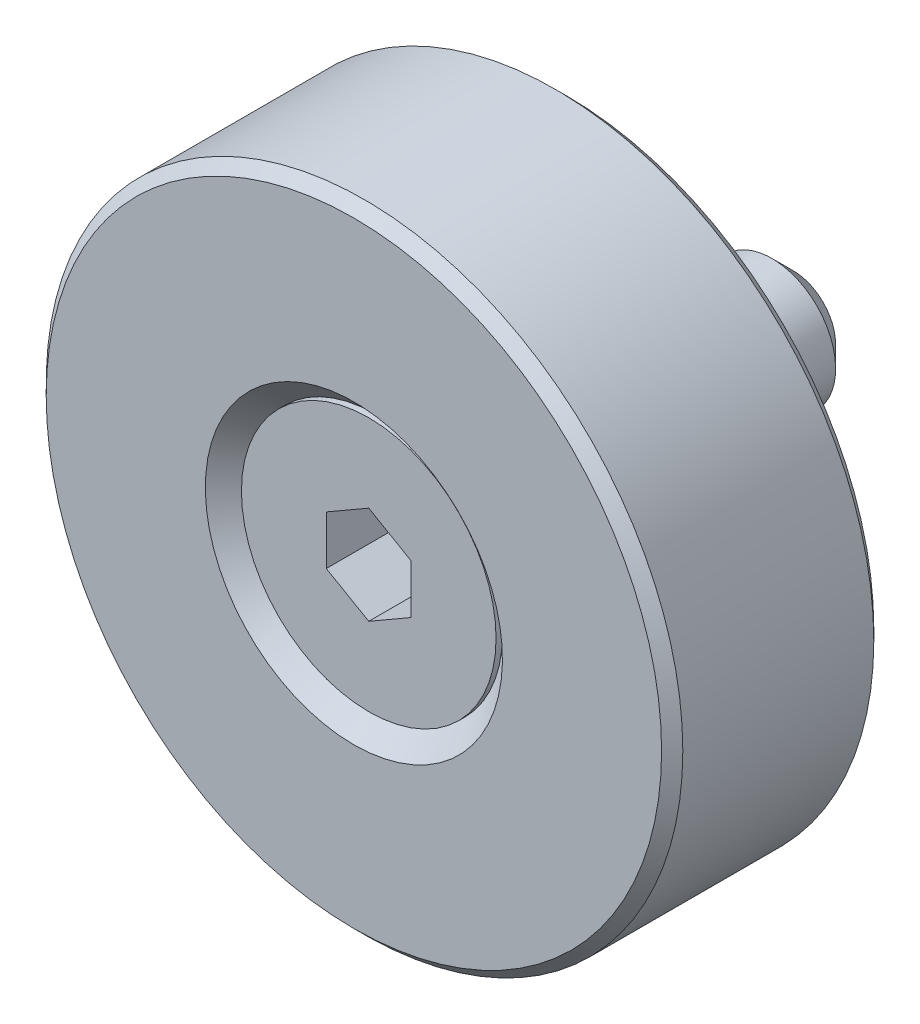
ISO-10303-21;
HEADER;
FILE_DESCRIPTION(('STEP AP214'),'2;1');
FILE_NAME('part.step','',(''),(''),'','','');
FILE_SCHEMA(('AUTOMOTIVE_DESIGN { 1 0 10303 214 1 1 1 1 }'));
ENDSEC;
DATA;
#1=APPLICATION_CONTEXT('core data for automotive mechanical design processes');
#2=APPLICATION_PROTOCOL_DEFINITION('international standard','automotive_design',2000,#1);
#3=PRODUCT_CONTEXT('',#1,'mechanical');
#4=PRODUCT('Part','Part','',(#3));
#5=PRODUCT_RELATED_PRODUCT_CATEGORY('part','',(#4));
#6=PRODUCT_DEFINITION_FORMATION('','',#4);
#7=PRODUCT_DEFINITION_CONTEXT('part definition',#1,'design');
#8=PRODUCT_DEFINITION('design','',#6,#7);
#9=PRODUCT_DEFINITION_SHAPE('','',#8);
#10=(LENGTH_UNIT() NAMED_UNIT(*) SI_UNIT(.MILLI.,.METRE.));
#11=(NAMED_UNIT(*) PLANE_ANGLE_UNIT() SI_UNIT($,.RADIAN.));
#12=(NAMED_UNIT(*) SI_UNIT($,.STERADIAN.) SOLID_ANGLE_UNIT());
#13=UNCERTAINTY_MEASURE_WITH_UNIT(LENGTH_MEASURE(1.E-05),#10,'distance_accuracy_value','');
#14=(GEOMETRIC_REPRESENTATION_CONTEXT(3) GLOBAL_UNCERTAINTY_ASSIGNED_CONTEXT((#13)) GLOBAL_UNIT_ASSIGNED_CONTEXT((#10,
#11,#12)) REPRESENTATION_CONTEXT('',''));
#15=CARTESIAN_POINT('',(0.,0.,0.));
#16=DIRECTION('',(0.,0.,1.));
#17=DIRECTION('',(1.,0.,0.));
#18=AXIS2_PLACEMENT_3D('',#15,#16,#17);
#19=CARTESIAN_POINT('',(0.,2.,-10.7));
#20=DIRECTION('',(0.,0.,1.));
#21=DIRECTION('',(0.,-1.,0.));
#22=AXIS2_PLACEMENT_3D('',#19,#20,#21);
#23=PLANE('',#22);
#24=CARTESIAN_POINT('',(0.,0.,-10.7));
#25=DIRECTION('',(0.,0.,1.));
#26=DIRECTION('',(0.,-1.,0.));
#27=AXIS2_PLACEMENT_3D('',#24,#25,#26);
#28=CIRCLE('',#27,2.);
#29=CARTESIAN_POINT('',(0.,-2.00000000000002,-10.7));
#30=VERTEX_POINT('',#29);
#31=EDGE_CURVE('E9',#30,#30,#28,.T.);
#32=ORIENTED_EDGE('',*,*,#31,.F.);
#33=EDGE_LOOP('',(#32));
#34=FACE_BOUND('',#33,.T.);
#35=ADVANCED_FACE('F14',(#34),#23,.F.);
#36=CARTESIAN_POINT('',(0.,0.,-10.7));
#37=DIRECTION('',(0.,0.,1.));
#38=DIRECTION('',(0.,-1.,0.));
#39=AXIS2_PLACEMENT_3D('',#36,#37,#38);
#40=CONICAL_SURFACE('',#39,2.,0.785398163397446);
#41=CARTESIAN_POINT('',(0.,0.,-9.7));
#42=DIRECTION('',(0.,0.,1.));
#43=DIRECTION('',(0.,-1.,0.));
#44=AXIS2_PLACEMENT_3D('',#41,#42,#43);
#45=CIRCLE('',#44,3.);
#46=CARTESIAN_POINT('',(0.,-3.00000000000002,-9.7));
#47=VERTEX_POINT('',#46);
#48=EDGE_CURVE('E21',#47,#47,#45,.T.);
#49=ORIENTED_EDGE('',*,*,#48,.F.);
#50=EDGE_LOOP('',(#49));
#51=FACE_BOUND('',#50,.T.);
#52=ORIENTED_EDGE('',*,*,#31,.T.);
#53=EDGE_LOOP('',(#52));
#54=FACE_BOUND('',#53,.T.);
#55=ADVANCED_FACE('F143',(#51,#54),#40,.T.);
#56=CARTESIAN_POINT('',(0.,0.,15.));
#57=DIRECTION('',(0.,0.,1.));
#58=DIRECTION('',(0.,-1.,0.));
#59=AXIS2_PLACEMENT_3D('',#56,#57,#58);
#60=CYLINDRICAL_SURFACE('',#59,3.);
#61=CARTESIAN_POINT('',(0.,0.,6.));
#62=DIRECTION('',(0.,0.,1.));
#63=DIRECTION('',(0.,-1.,0.));
#64=AXIS2_PLACEMENT_3D('',#61,#62,#63);
#65=CIRCLE('',#64,3.);
#66=CARTESIAN_POINT('',(0.,-2.99999999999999,6.00000000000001));
#67=VERTEX_POINT('',#66);
#68=EDGE_CURVE('E136',#67,#67,#65,.T.);
#69=ORIENTED_EDGE('',*,*,#68,.F.);
#70=EDGE_LOOP('',(#69));
#71=FACE_BOUND('',#70,.T.);
#72=ORIENTED_EDGE('',*,*,#48,.T.);
#73=EDGE_LOOP('',(#72));
#74=FACE_BOUND('',#73,.T.);
#75=ADVANCED_FACE('F141',(#71,#74),#60,.T.);
#76=CARTESIAN_POINT('',(0.,0.,6.));
#77=DIRECTION('',(0.,0.,1.));
#78=DIRECTION('',(0.,-1.,0.));
#79=AXIS2_PLACEMENT_3D('',#76,#77,#78);
#80=CONICAL_SURFACE('',#79,3.,0.785398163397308);
#81=CARTESIAN_POINT('',(0.,0.,6.19977548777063));
#82=DIRECTION('',(0.,0.,1.));
#83=DIRECTION('',(0.,-1.,0.));
#84=AXIS2_PLACEMENT_3D('',#81,#82,#83);
#85=CIRCLE('',#84,3.19977548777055);
#86=CARTESIAN_POINT('',(0.,-3.19977548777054,6.19977548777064));
#87=VERTEX_POINT('',#86);
#88=EDGE_CURVE('E133',#87,#87,#85,.T.);
#89=ORIENTED_EDGE('',*,*,#88,.F.);
#90=EDGE_LOOP('',(#89));
#91=FACE_BOUND('',#90,.T.);
#92=ORIENTED_EDGE('',*,*,#68,.T.);
#93=EDGE_LOOP('',(#92));
#94=FACE_BOUND('',#93,.T.);
#95=ADVANCED_FACE('F166',(#91,#94),#80,.T.);
#96=CARTESIAN_POINT('',(0.,0.,15.));
#97=DIRECTION('',(0.,0.,1.));
#98=DIRECTION('',(0.,-1.,0.));
#99=AXIS2_PLACEMENT_3D('',#96,#97,#98);
#100=CYLINDRICAL_SURFACE('',#99,3.19977548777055);
#101=CARTESIAN_POINT('',(0.,0.,0.));
#102=DIRECTION('',(0.,0.,1.));
#103=DIRECTION('',(0.,-1.,0.));
#104=AXIS2_PLACEMENT_3D('',#101,#102,#103);
#105=CIRCLE('',#104,3.19977548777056);
#106=CARTESIAN_POINT('',(0.,-3.19977548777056,0.));
#107=VERTEX_POINT('',#106);
#108=EDGE_CURVE('E130',#107,#107,#105,.T.);
#109=ORIENTED_EDGE('',*,*,#108,.F.);
#110=EDGE_LOOP('',(#109));
#111=FACE_BOUND('',#110,.T.);
#112=ORIENTED_EDGE('',*,*,#88,.T.);
#113=EDGE_LOOP('',(#112));
#114=FACE_BOUND('',#113,.T.);
#115=ADVANCED_FACE('F175',(#111,#114),#100,.F.);
#116=CARTESIAN_POINT('',(0.,3.19977548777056,0.));
#117=DIRECTION('',(0.,0.,1.));
#118=DIRECTION('',(0.,-1.,0.));
#119=AXIS2_PLACEMENT_3D('',#116,#117,#118);
#120=PLANE('',#119);
#121=ORIENTED_EDGE('',*,*,#108,.T.);
#122=EDGE_LOOP('',(#121));
#123=FACE_BOUND('',#122,.T.);
#124=CARTESIAN_POINT('',(0.,0.,0.));
#125=DIRECTION('',(0.,0.,1.));
#126=DIRECTION('',(1.,0.,0.));
#127=AXIS2_PLACEMENT_3D('',#124,#125,#126);
#128=CIRCLE('',#127,14.5);
#129=CARTESIAN_POINT('',(14.5,0.,0.));
#130=VERTEX_POINT('',#129);
#131=EDGE_CURVE('E361',#130,#130,#128,.T.);
#132=ORIENTED_EDGE('',*,*,#131,.F.);
#133=EDGE_LOOP('',(#132));
#134=FACE_BOUND('',#133,.T.);
#135=ADVANCED_FACE('F184',(#123,#134),#120,.F.);
#136=CARTESIAN_POINT('',(0.,0.,9.5));
#137=DIRECTION('',(0.,0.,-1.));
#138=DIRECTION('',(-1.,0.,0.));
#139=AXIS2_PLACEMENT_3D('',#136,#137,#138);
#140=CONICAL_SURFACE('',#139,15.,0.785398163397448);
#141=CARTESIAN_POINT('',(0.,0.,10.));
#142=DIRECTION('',(0.,0.,1.));
#143=DIRECTION('',(1.,0.,0.));
#144=AXIS2_PLACEMENT_3D('',#141,#142,#143);
#145=CIRCLE('',#144,14.5);
#146=CARTESIAN_POINT('',(14.5,0.,10.));
#147=VERTEX_POINT('',#146);
#148=EDGE_CURVE('E103',#147,#147,#145,.T.);
#149=ORIENTED_EDGE('',*,*,#148,.F.);
#150=EDGE_LOOP('',(#149));
#151=FACE_BOUND('',#150,.T.);
#152=CARTESIAN_POINT('',(0.,0.,9.5));
#153=DIRECTION('',(0.,0.,1.));
#154=DIRECTION('',(1.,0.,0.));
#155=AXIS2_PLACEMENT_3D('',#152,#153,#154);
#156=CIRCLE('',#155,15.);
#157=CARTESIAN_POINT('',(15.,0.,9.5));
#158=VERTEX_POINT('',#157);
#159=EDGE_CURVE('E344',#158,#158,#156,.T.);
#160=ORIENTED_EDGE('',*,*,#159,.T.);
#161=EDGE_LOOP('',(#160));
#162=FACE_BOUND('',#161,.T.);
#163=ADVANCED_FACE('F193',(#151,#162),#140,.T.);
#164=CARTESIAN_POINT('',(0.,0.,18.123338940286));
#165=DIRECTION('',(0.,0.,1.));
#166=DIRECTION('',(1.,0.,0.));
#167=AXIS2_PLACEMENT_3D('',#164,#165,#166);
#168=CYLINDRICAL_SURFACE('',#167,15.);
#169=ORIENTED_EDGE('',*,*,#159,.F.);
#170=EDGE_LOOP('',(#169));
#171=FACE_BOUND('',#170,.T.);
#172=CARTESIAN_POINT('',(0.,0.,0.5));
#173=DIRECTION('',(0.,0.,1.));
#174=DIRECTION('',(1.,0.,0.));
#175=AXIS2_PLACEMENT_3D('',#172,#173,#174);
#176=CIRCLE('',#175,15.);
#177=CARTESIAN_POINT('',(15.,0.,0.5));
#178=VERTEX_POINT('',#177);
#179=EDGE_CURVE('E347',#178,#178,#176,.T.);
#180=ORIENTED_EDGE('',*,*,#179,.T.);
#181=EDGE_LOOP('',(#180));
#182=FACE_BOUND('',#181,.T.);
#183=ADVANCED_FACE('F202',(#171,#182),#168,.T.);
#184=CARTESIAN_POINT('',(0.,0.,0.));
#185=DIRECTION('',(0.,0.,1.));
#186=DIRECTION('',(1.,0.,0.));
#187=AXIS2_PLACEMENT_3D('',#184,#185,#186);
#188=CONICAL_SURFACE('',#187,14.5,0.785398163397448);
#189=ORIENTED_EDGE('',*,*,#179,.F.);
#190=EDGE_LOOP('',(#189));
#191=FACE_BOUND('',#190,.T.);
#192=ORIENTED_EDGE('',*,*,#131,.T.);
#193=EDGE_LOOP('',(#192));
#194=FACE_BOUND('',#193,.T.);
#195=ADVANCED_FACE('F211',(#191,#194),#188,.T.);
#196=CARTESIAN_POINT('',(0.,2.30940107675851,6.3));
#197=DIRECTION('',(0.,0.,1.));
#198=DIRECTION('',(1.,0.,0.));
#199=AXIS2_PLACEMENT_3D('',#196,#197,#198);
#200=PLANE('',#199);
#201=DIRECTION('',(-0.866025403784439,0.5,0.));
#202=VECTOR('',#201,1.);
#203=CARTESIAN_POINT('',(2.,1.15470053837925,6.3));
#204=LINE('',#203,#202);
#205=CARTESIAN_POINT('',(2.,1.15470053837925,6.3));
#206=VERTEX_POINT('',#205);
#207=CARTESIAN_POINT('',(0.,2.30940107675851,6.3));
#208=VERTEX_POINT('',#207);
#209=EDGE_CURVE('E114',#206,#208,#204,.T.);
#210=ORIENTED_EDGE('',*,*,#209,.T.);
#211=DIRECTION('',(-0.866025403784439,-0.5,0.));
#212=VECTOR('',#211,1.);
#213=CARTESIAN_POINT('',(0.,2.30940107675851,6.3));
#214=LINE('',#213,#212);
#215=CARTESIAN_POINT('',(-2.,1.15470053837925,6.3));
#216=VERTEX_POINT('',#215);
#217=EDGE_CURVE('E96',#208,#216,#214,.T.);
#218=ORIENTED_EDGE('',*,*,#217,.T.);
#219=DIRECTION('',(0.,-1.,0.));
#220=VECTOR('',#219,1.);
#221=CARTESIAN_POINT('',(-2.,1.15470053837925,6.3));
#222=LINE('',#221,#220);
#223=CARTESIAN_POINT('',(-2.,-1.15470053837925,6.3));
#224=VERTEX_POINT('',#223);
#225=EDGE_CURVE('E94',#216,#224,#222,.T.);
#226=ORIENTED_EDGE('',*,*,#225,.T.);
#227=DIRECTION('',(0.866025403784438,-0.5,0.));
#228=VECTOR('',#227,1.);
#229=CARTESIAN_POINT('',(-2.,-1.15470053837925,6.3));
#230=LINE('',#229,#228);
#231=CARTESIAN_POINT('',(0.,-2.30940107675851,6.3));
#232=VERTEX_POINT('',#231);
#233=EDGE_CURVE('E73',#224,#232,#230,.T.);
#234=ORIENTED_EDGE('',*,*,#233,.T.);
#235=DIRECTION('',(0.866025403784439,0.5,0.));
#236=VECTOR('',#235,1.);
#237=CARTESIAN_POINT('',(0.,-2.30940107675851,6.3));
#238=LINE('',#237,#236);
#239=CARTESIAN_POINT('',(2.,-1.15470053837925,6.3));
#240=VERTEX_POINT('',#239);
#241=EDGE_CURVE('E84',#232,#240,#238,.T.);
#242=ORIENTED_EDGE('',*,*,#241,.T.);
#243=DIRECTION('',(0.,1.,0.));
#244=VECTOR('',#243,1.);
#245=CARTESIAN_POINT('',(2.,-1.15470053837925,6.3));
#246=LINE('',#245,#244);
#247=EDGE_CURVE('E88',#240,#206,#246,.T.);
#248=ORIENTED_EDGE('',*,*,#247,.T.);
#249=EDGE_LOOP('',(#210,#218,#226,#234,#242,#248));
#250=FACE_BOUND('',#249,.T.);
#251=ADVANCED_FACE('F91',(#250),#200,.T.);
#252=CARTESIAN_POINT('',(-2.,1.15470053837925,6.3));
#253=DIRECTION('',(-1.,0.,0.));
#254=DIRECTION('',(0.,-1.,0.));
#255=AXIS2_PLACEMENT_3D('',#252,#253,#254);
#256=PLANE('',#255);
#257=DIRECTION('',(0.,-1.,0.));
#258=VECTOR('',#257,1.);
#259=CARTESIAN_POINT('',(-2.,1.15470053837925,9.3));
#260=LINE('',#259,#258);
#261=CARTESIAN_POINT('',(-2.,1.15470053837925,9.3));
#262=VERTEX_POINT('',#261);
#263=CARTESIAN_POINT('',(-2.,-1.15470053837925,9.3));
#264=VERTEX_POINT('',#263);
#265=EDGE_CURVE('E106',#262,#264,#260,.T.);
#266=ORIENTED_EDGE('',*,*,#265,.T.);
#267=DIRECTION('',(0.,0.,1.));
#268=VECTOR('',#267,1.);
#269=CARTESIAN_POINT('',(-2.,-1.15470053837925,6.3));
#270=LINE('',#269,#268);
#271=EDGE_CURVE('E81',#224,#264,#270,.T.);
#272=ORIENTED_EDGE('',*,*,#271,.F.);
#273=ORIENTED_EDGE('',*,*,#225,.F.);
#274=DIRECTION('',(0.,0.,1.));
#275=VECTOR('',#274,1.);
#276=CARTESIAN_POINT('',(-2.,1.15470053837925,6.3));
#277=LINE('',#276,#275);
#278=EDGE_CURVE('E119',#216,#262,#277,.T.);
#279=ORIENTED_EDGE('',*,*,#278,.T.);
#280=EDGE_LOOP('',(#266,#272,#273,#279));
#281=FACE_BOUND('',#280,.T.);
#282=ADVANCED_FACE('F228',(#281),#256,.F.);
#283=CARTESIAN_POINT('',(-2.,-1.15470053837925,6.3));
#284=DIRECTION('',(-0.5,-0.866025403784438,0.));
#285=DIRECTION('',(0.866025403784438,-0.5,0.));
#286=AXIS2_PLACEMENT_3D('',#283,#284,#285);
#287=PLANE('',#286);
#288=DIRECTION('',(0.866025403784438,-0.5,0.));
#289=VECTOR('',#288,1.);
#290=CARTESIAN_POINT('',(-2.,-1.15470053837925,9.3));
#291=LINE('',#290,#289);
#292=CARTESIAN_POINT('',(0.,-2.30940107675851,9.3));
#293=VERTEX_POINT('',#292);
#294=EDGE_CURVE('E76',#264,#293,#291,.T.);
#295=ORIENTED_EDGE('',*,*,#294,.T.);
#296=DIRECTION('',(0.,0.,1.));
#297=VECTOR('',#296,1.);
#298=CARTESIAN_POINT('',(0.,-2.30940107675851,6.3));
#299=LINE('',#298,#297);
#300=EDGE_CURVE('E69',#232,#293,#299,.T.);
#301=ORIENTED_EDGE('',*,*,#300,.F.);
#302=ORIENTED_EDGE('',*,*,#233,.F.);
#303=ORIENTED_EDGE('',*,*,#271,.T.);
#304=EDGE_LOOP('',(#295,#301,#302,#303));
#305=FACE_BOUND('',#304,.T.);
#306=ADVANCED_FACE('F71',(#305),#287,.F.);
#307=CARTESIAN_POINT('',(0.,-2.30940107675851,6.3));
#308=DIRECTION('',(0.5,-0.866025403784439,0.));
#309=DIRECTION('',(0.866025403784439,0.5,0.));
#310=AXIS2_PLACEMENT_3D('',#307,#308,#309);
#311=PLANE('',#310);
#312=DIRECTION('',(0.866025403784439,0.5,0.));
#313=VECTOR('',#312,1.);
#314=CARTESIAN_POINT('',(0.,-2.30940107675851,9.3));
#315=LINE('',#314,#313);
#316=CARTESIAN_POINT('',(2.,-1.15470053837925,9.3));
#317=VERTEX_POINT('',#316);
#318=EDGE_CURVE('E110',#293,#317,#315,.T.);
#319=ORIENTED_EDGE('',*,*,#318,.T.);
#320=DIRECTION('',(0.,0.,1.));
#321=VECTOR('',#320,1.);
#322=CARTESIAN_POINT('',(2.,-1.15470053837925,6.3));
#323=LINE('',#322,#321);
#324=EDGE_CURVE('E80',#240,#317,#323,.T.);
#325=ORIENTED_EDGE('',*,*,#324,.F.);
#326=ORIENTED_EDGE('',*,*,#241,.F.);
#327=ORIENTED_EDGE('',*,*,#300,.T.);
#328=EDGE_LOOP('',(#319,#325,#326,#327));
#329=FACE_BOUND('',#328,.T.);
#330=ADVANCED_FACE('F85',(#329),#311,.F.);
#331=CARTESIAN_POINT('',(2.,-1.15470053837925,6.3));
#332=DIRECTION('',(1.,0.,0.));
#333=DIRECTION('',(0.,1.,0.));
#334=AXIS2_PLACEMENT_3D('',#331,#332,#333);
#335=PLANE('',#334);
#336=DIRECTION('',(0.,1.,0.));
#337=VECTOR('',#336,1.);
#338=CARTESIAN_POINT('',(2.,-1.15470053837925,9.3));
#339=LINE('',#338,#337);
#340=CARTESIAN_POINT('',(2.,1.15470053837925,9.3));
#341=VERTEX_POINT('',#340);
#342=EDGE_CURVE('E112',#317,#341,#339,.T.);
#343=ORIENTED_EDGE('',*,*,#342,.T.);
#344=DIRECTION('',(0.,0.,1.));
#345=VECTOR('',#344,1.);
#346=CARTESIAN_POINT('',(2.,1.15470053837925,6.3));
#347=LINE('',#346,#345);
#348=EDGE_CURVE('E36',#206,#341,#347,.T.);
#349=ORIENTED_EDGE('',*,*,#348,.F.);
#350=ORIENTED_EDGE('',*,*,#247,.F.);
#351=ORIENTED_EDGE('',*,*,#324,.T.);
#352=EDGE_LOOP('',(#343,#349,#350,#351));
#353=FACE_BOUND('',#352,.T.);
#354=ADVANCED_FACE('F251',(#353),#335,.F.);
#355=CARTESIAN_POINT('',(2.,1.15470053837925,6.3));
#356=DIRECTION('',(0.5,0.866025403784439,0.));
#357=DIRECTION('',(-0.866025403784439,0.5,0.));
#358=AXIS2_PLACEMENT_3D('',#355,#356,#357);
#359=PLANE('',#358);
#360=DIRECTION('',(-0.866025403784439,0.5,0.));
#361=VECTOR('',#360,1.);
#362=CARTESIAN_POINT('',(2.,1.15470053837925,9.3));
#363=LINE('',#362,#361);
#364=CARTESIAN_POINT('',(0.,2.30940107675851,9.3));
#365=VERTEX_POINT('',#364);
#366=EDGE_CURVE('E28',#341,#365,#363,.T.);
#367=ORIENTED_EDGE('',*,*,#366,.T.);
#368=DIRECTION('',(0.,0.,1.));
#369=VECTOR('',#368,1.);
#370=CARTESIAN_POINT('',(0.,2.30940107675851,6.3));
#371=LINE('',#370,#369);
#372=EDGE_CURVE('E58',#208,#365,#371,.T.);
#373=ORIENTED_EDGE('',*,*,#372,.F.);
#374=ORIENTED_EDGE('',*,*,#209,.F.);
#375=ORIENTED_EDGE('',*,*,#348,.T.);
#376=EDGE_LOOP('',(#367,#373,#374,#375));
#377=FACE_BOUND('',#376,.T.);
#378=ADVANCED_FACE('F259',(#377),#359,.F.);
#379=CARTESIAN_POINT('',(0.,2.30940107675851,6.3));
#380=DIRECTION('',(-0.5,0.866025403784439,0.));
#381=DIRECTION('',(-0.866025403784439,-0.5,0.));
#382=AXIS2_PLACEMENT_3D('',#379,#380,#381);
#383=PLANE('',#382);
#384=DIRECTION('',(-0.866025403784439,-0.5,0.));
#385=VECTOR('',#384,1.);
#386=CARTESIAN_POINT('',(0.,2.30940107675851,9.3));
#387=LINE('',#386,#385);
#388=EDGE_CURVE('E102',#365,#262,#387,.T.);
#389=ORIENTED_EDGE('',*,*,#388,.T.);
#390=ORIENTED_EDGE('',*,*,#278,.F.);
#391=ORIENTED_EDGE('',*,*,#217,.F.);
#392=ORIENTED_EDGE('',*,*,#372,.T.);
#393=EDGE_LOOP('',(#389,#390,#391,#392));
#394=FACE_BOUND('',#393,.T.);
#395=ADVANCED_FACE('F267',(#394),#383,.F.);
#396=CARTESIAN_POINT('',(0.,0.,9.3));
#397=DIRECTION('',(0.,0.,-1.));
#398=DIRECTION('',(0.,1.,0.));
#399=AXIS2_PLACEMENT_3D('',#396,#397,#398);
#400=PLANE('',#399);
#401=ORIENTED_EDGE('',*,*,#388,.F.);
#402=ORIENTED_EDGE('',*,*,#366,.F.);
#403=ORIENTED_EDGE('',*,*,#342,.F.);
#404=ORIENTED_EDGE('',*,*,#318,.F.);
#405=ORIENTED_EDGE('',*,*,#294,.F.);
#406=ORIENTED_EDGE('',*,*,#265,.F.);
#407=EDGE_LOOP('',(#401,#402,#403,#404,#405,#406));
#408=FACE_BOUND('',#407,.T.);
#409=CARTESIAN_POINT('',(0.,0.,9.3));
#410=DIRECTION('',(0.,0.,1.));
#411=DIRECTION('',(0.,-1.,0.));
#412=AXIS2_PLACEMENT_3D('',#409,#410,#411);
#413=CIRCLE('',#412,6.);
#414=CARTESIAN_POINT('',(0.,-5.99999999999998,9.30000000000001));
#415=VERTEX_POINT('',#414);
#416=EDGE_CURVE('E116',#415,#415,#413,.T.);
#417=ORIENTED_EDGE('',*,*,#416,.T.);
#418=EDGE_LOOP('',(#417));
#419=FACE_BOUND('',#418,.T.);
#420=ADVANCED_FACE('F275',(#408,#419),#400,.F.);
#421=CARTESIAN_POINT('',(0.,0.,15.));
#422=DIRECTION('',(0.,0.,1.));
#423=DIRECTION('',(0.,-1.,0.));
#424=AXIS2_PLACEMENT_3D('',#421,#422,#423);
#425=CYLINDRICAL_SURFACE('',#424,6.);
#426=ORIENTED_EDGE('',*,*,#416,.F.);
#427=EDGE_LOOP('',(#426));
#428=FACE_BOUND('',#427,.T.);
#429=CARTESIAN_POINT('',(0.,0.,9.));
#430=DIRECTION('',(0.,0.,1.));
#431=DIRECTION('',(0.,-1.,0.));
#432=AXIS2_PLACEMENT_3D('',#429,#430,#431);
#433=CIRCLE('',#432,6.);
#434=CARTESIAN_POINT('',(0.,-5.99999999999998,9.00000000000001));
#435=VERTEX_POINT('',#434);
#436=EDGE_CURVE('E124',#435,#435,#433,.T.);
#437=ORIENTED_EDGE('',*,*,#436,.T.);
#438=EDGE_LOOP('',(#437));
#439=FACE_BOUND('',#438,.T.);
#440=ADVANCED_FACE('F284',(#428,#439),#425,.T.);
#441=CARTESIAN_POINT('',(0.,0.,10.));
#442=DIRECTION('',(0.,0.,1.));
#443=DIRECTION('',(0.,-1.,0.));
#444=AXIS2_PLACEMENT_3D('',#441,#442,#443);
#445=CONICAL_SURFACE('',#444,7.,0.785398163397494);
#446=ORIENTED_EDGE('',*,*,#436,.F.);
#447=EDGE_LOOP('',(#446));
#448=FACE_BOUND('',#447,.T.);
#449=CARTESIAN_POINT('',(0.,0.,10.));
#450=DIRECTION('',(0.,0.,1.));
#451=DIRECTION('',(0.,-1.,0.));
#452=AXIS2_PLACEMENT_3D('',#449,#450,#451);
#453=CIRCLE('',#452,7.);
#454=CARTESIAN_POINT('',(0.,-6.99999999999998,10.));
#455=VERTEX_POINT('',#454);
#456=EDGE_CURVE('E127',#455,#455,#453,.T.);
#457=ORIENTED_EDGE('',*,*,#456,.T.);
#458=EDGE_LOOP('',(#457));
#459=FACE_BOUND('',#458,.T.);
#460=ADVANCED_FACE('F293',(#448,#459),#445,.F.);
#461=CARTESIAN_POINT('',(0.,12.,10.));
#462=DIRECTION('',(0.,0.,-1.));
#463=DIRECTION('',(0.,1.,0.));
#464=AXIS2_PLACEMENT_3D('',#461,#462,#463);
#465=PLANE('',#464);
#466=ORIENTED_EDGE('',*,*,#456,.F.);
#467=EDGE_LOOP('',(#466));
#468=FACE_BOUND('',#467,.T.);
#469=ORIENTED_EDGE('',*,*,#148,.T.);
#470=EDGE_LOOP('',(#469));
#471=FACE_BOUND('',#470,.T.);
#472=ADVANCED_FACE('F302',(#468,#471),#465,.F.);
#473=CLOSED_SHELL('',(#35,#55,#75,#95,#115,#135,#163,#183,#195,#251,#282,#306,#330,#354,#378,
#395,#420,#440,#460,#472));
#474=MANIFOLD_SOLID_BREP('B1',#473);
#475=ADVANCED_BREP_SHAPE_REPRESENTATION('',(#18,#474),#14);
#476=SHAPE_DEFINITION_REPRESENTATION(#9,#475);
ENDSEC;
END-ISO-10303-21;
